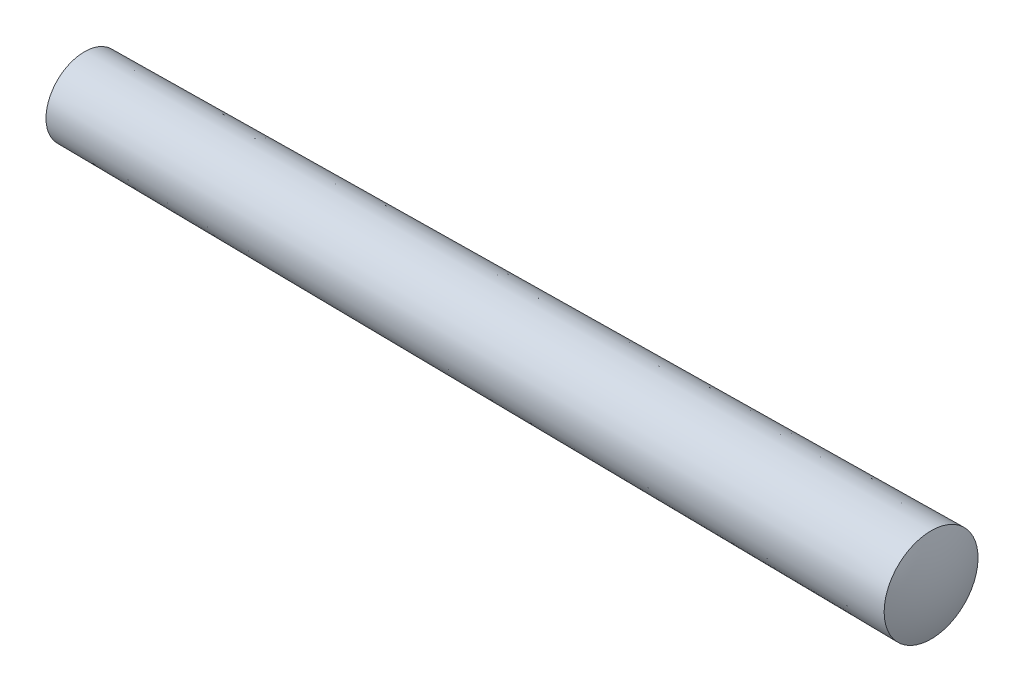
ISO-10303-21;
HEADER;
FILE_DESCRIPTION(('STEP AP214'),'2;1');
FILE_NAME('part.step','',(''),(''),'','','');
FILE_SCHEMA(('AUTOMOTIVE_DESIGN { 1 0 10303 214 1 1 1 1 }'));
ENDSEC;
DATA;
#1=APPLICATION_CONTEXT('core data for automotive mechanical design processes');
#2=APPLICATION_PROTOCOL_DEFINITION('international standard','automotive_design',2000,#1);
#3=PRODUCT_CONTEXT('',#1,'mechanical');
#4=PRODUCT('Part','Part','',(#3));
#5=PRODUCT_RELATED_PRODUCT_CATEGORY('part','',(#4));
#6=PRODUCT_DEFINITION_FORMATION('','',#4);
#7=PRODUCT_DEFINITION_CONTEXT('part definition',#1,'design');
#8=PRODUCT_DEFINITION('design','',#6,#7);
#9=PRODUCT_DEFINITION_SHAPE('','',#8);
#10=(LENGTH_UNIT() NAMED_UNIT(*) SI_UNIT(.MILLI.,.METRE.));
#11=(NAMED_UNIT(*) PLANE_ANGLE_UNIT() SI_UNIT($,.RADIAN.));
#12=(NAMED_UNIT(*) SI_UNIT($,.STERADIAN.) SOLID_ANGLE_UNIT());
#13=UNCERTAINTY_MEASURE_WITH_UNIT(LENGTH_MEASURE(1.E-05),#10,'distance_accuracy_value','');
#14=(GEOMETRIC_REPRESENTATION_CONTEXT(3) GLOBAL_UNCERTAINTY_ASSIGNED_CONTEXT((#13)) GLOBAL_UNIT_ASSIGNED_CONTEXT((#10,
#11,#12)) REPRESENTATION_CONTEXT('',''));
#15=CARTESIAN_POINT('',(0.,0.,0.));
#16=DIRECTION('',(0.,0.,1.));
#17=DIRECTION('',(1.,0.,0.));
#18=AXIS2_PLACEMENT_3D('',#15,#16,#17);
#19=CARTESIAN_POINT('',(38.7964000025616,0.,0.));
#20=DIRECTION('',(-1.,0.,0.));
#21=DIRECTION('',(0.,1.,0.));
#22=AXIS2_PLACEMENT_3D('',#19,#20,#21);
#23=SPHERICAL_SURFACE('',#22,6.20359999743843);
#24=CARTESIAN_POINT('',(44.5,0.,0.));
#25=DIRECTION('',(-1.,0.,0.));
#26=DIRECTION('',(0.,0.,1.));
#27=AXIS2_PLACEMENT_3D('',#24,#25,#26);
#28=CIRCLE('',#27,2.43999999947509);
#29=CARTESIAN_POINT('',(44.5,0.,2.43999999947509));
#30=VERTEX_POINT('',#29);
#31=EDGE_CURVE('E34',#30,#30,#28,.T.);
#32=ORIENTED_EDGE('',*,*,#31,.F.);
#33=EDGE_LOOP('',(#32));
#34=FACE_BOUND('',#33,.T.);
#35=ADVANCED_FACE('F28',(#34),#23,.T.);
#36=CARTESIAN_POINT('',(4.25,0.,0.));
#37=DIRECTION('',(-1.,0.,0.));
#38=DIRECTION('',(0.,1.,0.));
#39=AXIS2_PLACEMENT_3D('',#36,#37,#38);
#40=SPHERICAL_SURFACE('',#39,4.25);
#41=CARTESIAN_POINT('',(0.5,0.,0.));
#42=DIRECTION('',(-1.,0.,0.));
#43=DIRECTION('',(0.,0.,1.));
#44=AXIS2_PLACEMENT_3D('',#41,#42,#43);
#45=CIRCLE('',#44,2.);
#46=CARTESIAN_POINT('',(0.5,0.,2.));
#47=VERTEX_POINT('',#46);
#48=EDGE_CURVE('E10',#47,#47,#45,.T.);
#49=ORIENTED_EDGE('',*,*,#48,.T.);
#50=EDGE_LOOP('',(#49));
#51=FACE_BOUND('',#50,.T.);
#52=ADVANCED_FACE('F43',(#51),#40,.T.);
#53=CARTESIAN_POINT('',(44.5,0.,0.));
#54=DIRECTION('',(1.,0.,0.));
#55=DIRECTION('',(0.,0.,-1.));
#56=AXIS2_PLACEMENT_3D('',#53,#54,#55);
#57=CONICAL_SURFACE('',#56,2.43999999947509,0.00999966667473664);
#58=ORIENTED_EDGE('',*,*,#48,.F.);
#59=EDGE_LOOP('',(#58));
#60=FACE_BOUND('',#59,.T.);
#61=ORIENTED_EDGE('',*,*,#31,.T.);
#62=EDGE_LOOP('',(#61));
#63=FACE_BOUND('',#62,.T.);
#64=ADVANCED_FACE('F40',(#60,#63),#57,.T.);
#65=CLOSED_SHELL('',(#35,#52,#64));
#66=MANIFOLD_SOLID_BREP('B2',#65);
#67=ADVANCED_BREP_SHAPE_REPRESENTATION('',(#18,#66),#14);
#68=SHAPE_DEFINITION_REPRESENTATION(#9,#67);
ENDSEC;
END-ISO-10303-21;
